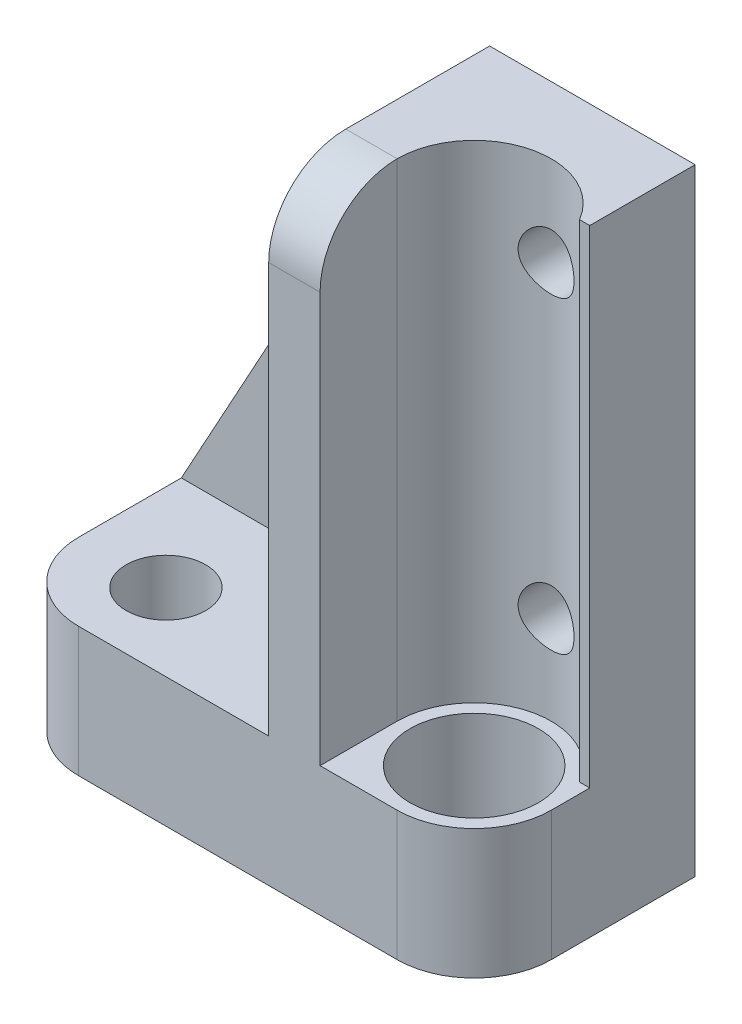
from build123d import *

# Parameters (mm, degrees)
BOSS_EXTRUDE1_DEPTH                            = 8.89
SKETCH3_W                                      = 16.51
SKETCH3_H                                      = 15.24
CUT_EXTRUDE2_DEPTH                             = 30.099
SKETCH5_W                                      = 29.21
SKETCH5_H                                      = 4.1275
CUT_EXTRUDE4_DEPTH                             = 47.133744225
CBORE_FOR_8_SOCKET_HEAD_CAP_SCREW1_D           = 4.9149
CBORE_FOR_8_SOCKET_HEAD_CAP_SCREW1_CBORE_D     = 7.9375
CBORE_FOR_8_SOCKET_HEAD_CAP_SCREW1_CBORE_DEPTH = 5.8166
F_10_0_1935_DIAMETER_HOLE2_D                   = 4.9149
F_8_32_TAPPED_HOLE1_D                          = 3.4544
FILLET1_R                                      = 4.7625


with BuildPart() as part:
    # Sketch1 → Boss-Extrude1 (new, symmetric)
    with BuildSketch(Plane.XY):
        Polygon((-24.4475, 0), (4.7625, 0), (4.7625, 38.1), (-7.9375, 38.1), (-24.4475, 8.001), align=None)
    extrude(amount=BOSS_EXTRUDE1_DEPTH, both=True)

    # Sketch3 → Cut-Extrude2 (cut)
    with BuildSketch(Plane(origin=(0, 38.1, 0), x_dir=(1, 0, 0), z_dir=(0, 1, 0))):
        with Locations((-16.1925, -1.27)):
            Rectangle(SKETCH3_W, SKETCH3_H)
        with BuildLine():
            Line((4.1275, 2.375952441), (4.7625, 2.375952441))
            Line((4.7625, 2.375952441), (4.7625, -8.89))
            Line((4.7625, -8.89), (-4.7625, -8.89))
            Line((-4.7625, -8.89), (-4.7625, 0))
            ThreePointArc((-4.7625, 0), (-1.229672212, 4.601012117), (4.1275, 2.375952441))
        make_face()
    extrude(amount=-CUT_EXTRUDE2_DEPTH, mode=Mode.SUBTRACT)

    # Sketch5 → Cut-Extrude4 (cut, through all)
    with BuildSketch(Plane(origin=(0, 38.1, 0), x_dir=(1, 0, 0), z_dir=(0, 1, 0))):
        with Locations((-9.8425, -6.82625)):
            Rectangle(SKETCH5_W, SKETCH5_H)
    extrude(amount=-CUT_EXTRUDE4_DEPTH, mode=Mode.SUBTRACT)

    # CBORE for _8 Socket Head Cap Screw1 (through all)
    with Locations(Plane(origin=(0, 8.001, 0), x_dir=(1, 0, 0), z_dir=(0, 1, 0))):
        with Locations((0, 0)):
            CounterBoreHole(CBORE_FOR_8_SOCKET_HEAD_CAP_SCREW1_D / 2, CBORE_FOR_8_SOCKET_HEAD_CAP_SCREW1_CBORE_D / 2, CBORE_FOR_8_SOCKET_HEAD_CAP_SCREW1_CBORE_DEPTH)

    # 10 _0.1935_ Diameter Hole2 (through all)
    with Locations(Plane(origin=(0, 8.001, 0), x_dir=(1, 0, 0), z_dir=(0, 1, 0))):
        with Locations((-19.05, 0)):
            Hole(F_10_0_1935_DIAMETER_HOLE2_D / 2)

    # 8-32 Tapped Hole1 (through all)
    with Locations(Plane(origin=(0, 0, -8.89), x_dir=(-1, 0, 0), z_dir=(0, 0, -1))):
        with Locations((0, 32.5755), (0, 13.5255)):
            Hole(F_8_32_TAPPED_HOLE1_D / 2)

    # Fillet1
    fillet1_edges = [part.edges().sort_by_distance(p)[0] for p in [
        (-7.9375, 23.0505, -6.35),
        (-24.4475, 4.0005, 4.7625),
        (4.7625, 4.0005, 4.7625),
        (-6.35, 38.1, 4.7625),
    ]]
    fillet(fillet1_edges, radius=FILLET1_R)


solid = part.part
